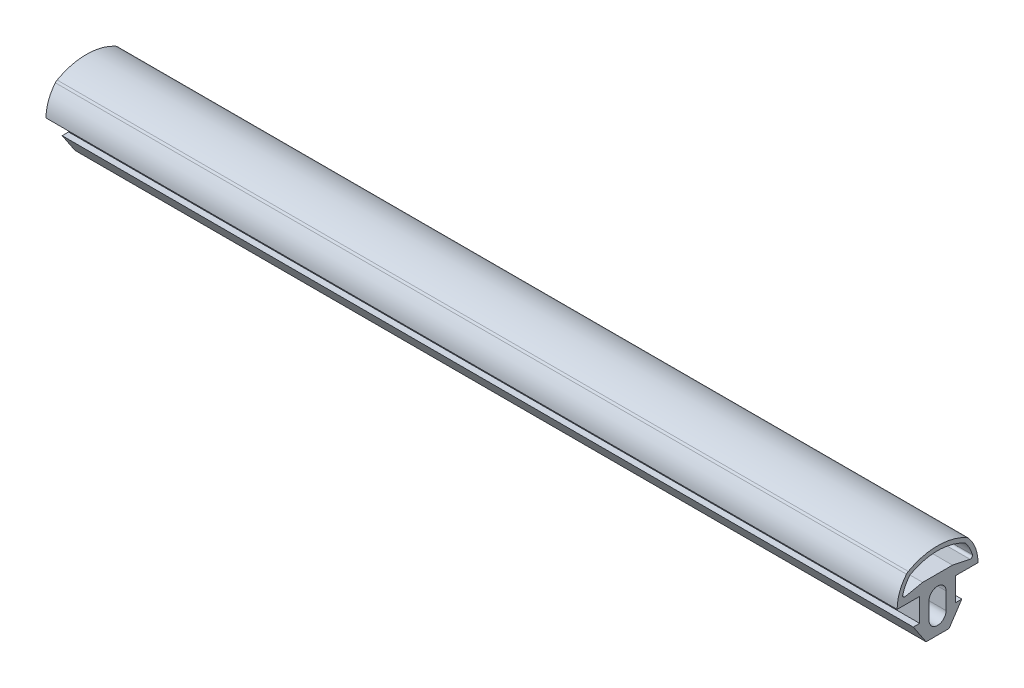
from build123d import *

# Parameters (mm, degrees)
TIIVISTEKUMIT_1_6026_TIIVISTEKUMI_1_DEPTH = 200


with BuildPart() as part:
    # Sketch1 → Tiivistekumit 1.6026 TIIVISTEKUMI_1 (new body)
    with BuildSketch(Plane(origin=(0, 0, 0), x_dir=(0, 0, -1), z_dir=(1, 0, 0))):
        with BuildLine():
            Line((-9.237786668, 0.965554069), (-3.937783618, 0.965554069))
            Line((-3.937783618, 0.965554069), (-3.937783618, -4.534445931))
            Line((-3.937783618, -4.534445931), (-5.437783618, -4.534445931))
            Line((-5.437783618, -4.534445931), (-2.437783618, -9.034445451))
            Line((-2.437783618, -9.034445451), (2.962202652, -9.034445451))
            Line((2.962202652, -9.034445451), (5.962202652, -4.534445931))
            Line((5.962202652, -4.534445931), (4.462202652, -4.534445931))
            Line((4.462202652, -4.534445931), (4.462202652, 0.965554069))
            Line((4.462202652, 0.965554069), (9.762212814, 0.965554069))
            ThreePointArc((9.762212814, 0.965554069), (9.198467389, 4.189443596), (7.574120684, 7.030705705))
            ThreePointArc((7.574120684, 7.030705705), (7.37701254, 7.227766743), (7.146852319, 7.384963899))
            ThreePointArc((7.146852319, 7.384963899), (0.26221226, 9.165553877), (-6.622427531, 7.384962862))
            ThreePointArc((-6.622427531, 7.384962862), (-6.85258596, 7.227771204), (-7.049687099, 7.030709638))
            ThreePointArc((-7.049687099, 7.030709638), (-8.674034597, 4.189445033), (-9.237786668, 0.965554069))
        make_face()
        with BuildLine():
            Line((-3.237786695, 3.465554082), (-7.343942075, 2.621811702))
            ThreePointArc((-7.343942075, 2.621811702), (-7.810099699, 2.770419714), (-7.926248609, 3.245705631))
            ThreePointArc((-7.926248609, 3.245705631), (-7.269288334, 4.905919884), (-6.280013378, 6.392272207))
            ThreePointArc((-6.280013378, 6.392272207), (-6.21431388, 6.457960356), (-6.13759367, 6.510356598))
            ThreePointArc((-6.13759367, 6.510356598), (0.26221274, 8.165551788), (6.662018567, 6.510354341))
            ThreePointArc((6.662018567, 6.510354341), (6.738736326, 6.457955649), (6.804439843, 6.392272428))
            ThreePointArc((6.804439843, 6.392272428), (7.793714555, 4.905920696), (8.450674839, 3.245707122))
            ThreePointArc((8.450674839, 3.245707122), (8.334519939, 2.770421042), (7.868361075, 2.621811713))
            Line((7.868361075, 2.621811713), (3.762205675, 3.465554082))
            Line((3.762205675, 3.465554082), (-3.237786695, 3.465554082))
        make_face(mode=Mode.SUBTRACT)
        with BuildLine():
            Line((2.262206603, -1.034443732), (2.262206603, -5.034447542))
            ThreePointArc((2.262206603, -5.034447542), (0.262212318, -7.034447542), (-1.737785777, -5.034451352))
            Line((-1.737785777, -5.034451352), (-1.737785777, -1.034447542))
            ThreePointArc((-1.737785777, -1.034447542), (0.262208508, 0.965550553), (2.262206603, -1.034443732))
        make_face(mode=Mode.SUBTRACT)
    extrude(amount=TIIVISTEKUMIT_1_6026_TIIVISTEKUMI_1_DEPTH)


solid = part.part
